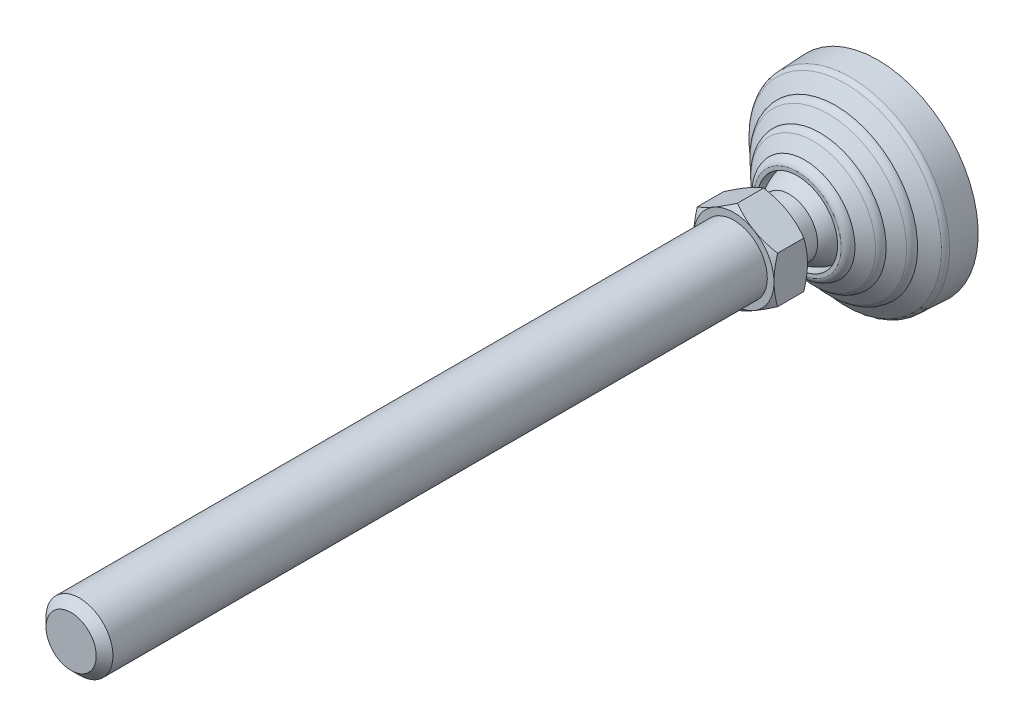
ISO-10303-21;
HEADER;
FILE_DESCRIPTION(('STEP AP214'),'2;1');
FILE_NAME('part.step','',(''),(''),'','','');
FILE_SCHEMA(('AUTOMOTIVE_DESIGN { 1 0 10303 214 1 1 1 1 }'));
ENDSEC;
DATA;
#1=APPLICATION_CONTEXT('core data for automotive mechanical design processes');
#2=APPLICATION_PROTOCOL_DEFINITION('international standard','automotive_design',2000,#1);
#3=PRODUCT_CONTEXT('',#1,'mechanical');
#4=PRODUCT('Part','Part','',(#3));
#5=PRODUCT_RELATED_PRODUCT_CATEGORY('part','',(#4));
#6=PRODUCT_DEFINITION_FORMATION('','',#4);
#7=PRODUCT_DEFINITION_CONTEXT('part definition',#1,'design');
#8=PRODUCT_DEFINITION('design','',#6,#7);
#9=PRODUCT_DEFINITION_SHAPE('','',#8);
#10=(LENGTH_UNIT() NAMED_UNIT(*) SI_UNIT(.MILLI.,.METRE.));
#11=(NAMED_UNIT(*) PLANE_ANGLE_UNIT() SI_UNIT($,.RADIAN.));
#12=(NAMED_UNIT(*) SI_UNIT($,.STERADIAN.) SOLID_ANGLE_UNIT());
#13=UNCERTAINTY_MEASURE_WITH_UNIT(LENGTH_MEASURE(1.E-05),#10,'distance_accuracy_value','');
#14=(GEOMETRIC_REPRESENTATION_CONTEXT(3) GLOBAL_UNCERTAINTY_ASSIGNED_CONTEXT((#13)) GLOBAL_UNIT_ASSIGNED_CONTEXT((#10,
#11,#12)) REPRESENTATION_CONTEXT('',''));
#15=CARTESIAN_POINT('',(0.,0.,0.));
#16=DIRECTION('',(0.,0.,1.));
#17=DIRECTION('',(1.,0.,0.));
#18=AXIS2_PLACEMENT_3D('',#15,#16,#17);
#19=CARTESIAN_POINT('',(0.,0.,110.4665));
#20=DIRECTION('',(0.,0.,-1.));
#21=DIRECTION('',(0.,1.,0.));
#22=AXIS2_PLACEMENT_3D('',#19,#20,#21);
#23=CYLINDRICAL_SURFACE('',#22,10.);
#24=CARTESIAN_POINT('',(0.,0.,238.5));
#25=DIRECTION('',(0.,0.,1.));
#26=DIRECTION('',(0.,-1.,0.));
#27=AXIS2_PLACEMENT_3D('',#24,#25,#26);
#28=CIRCLE('',#27,10.);
#29=CARTESIAN_POINT('',(0.,-10.,238.5));
#30=VERTEX_POINT('',#29);
#31=EDGE_CURVE('E9',#30,#30,#28,.F.);
#32=ORIENTED_EDGE('',*,*,#31,.T.);
#33=EDGE_LOOP('',(#32));
#34=FACE_BOUND('',#33,.T.);
#35=CARTESIAN_POINT('',(0.,0.,43.));
#36=DIRECTION('',(0.,0.,-1.));
#37=DIRECTION('',(0.,1.,0.));
#38=AXIS2_PLACEMENT_3D('',#35,#36,#37);
#39=CIRCLE('',#38,10.);
#40=CARTESIAN_POINT('',(0.,10.,43.));
#41=VERTEX_POINT('',#40);
#42=EDGE_CURVE('E124',#41,#41,#39,.F.);
#43=ORIENTED_EDGE('',*,*,#42,.T.);
#44=EDGE_LOOP('',(#43));
#45=FACE_BOUND('',#44,.T.);
#46=ADVANCED_FACE('F14',(#34,#45),#23,.T.);
#47=CARTESIAN_POINT('',(10.995,0.,43.));
#48=DIRECTION('',(0.,0.,1.));
#49=DIRECTION('',(0.,-1.,0.));
#50=AXIS2_PLACEMENT_3D('',#47,#48,#49);
#51=PLANE('',#50);
#52=CARTESIAN_POINT('',(0.,0.,43.));
#53=DIRECTION('',(0.,0.,-1.));
#54=DIRECTION('',(0.,1.,0.));
#55=AXIS2_PLACEMENT_3D('',#52,#53,#54);
#56=CIRCLE('',#55,11.99);
#57=CARTESIAN_POINT('',(0.,11.99,43.));
#58=VERTEX_POINT('',#57);
#59=EDGE_CURVE('E132',#58,#58,#56,.F.);
#60=ORIENTED_EDGE('',*,*,#59,.T.);
#61=EDGE_LOOP('',(#60));
#62=FACE_BOUND('',#61,.T.);
#63=ORIENTED_EDGE('',*,*,#42,.F.);
#64=EDGE_LOOP('',(#63));
#65=FACE_BOUND('',#64,.T.);
#66=ADVANCED_FACE('F157',(#62,#65),#51,.T.);
#67=CARTESIAN_POINT('',(0.,0.,41.9159643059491));
#68=DIRECTION('',(0.,0.,-1.));
#69=DIRECTION('',(0.,1.,0.));
#70=AXIS2_PLACEMENT_3D('',#67,#68,#69);
#71=CONICAL_SURFACE('',#70,13.8676048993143,1.0471975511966);
#72=ORIENTED_EDGE('',*,*,#59,.F.);
#73=EDGE_LOOP('',(#72));
#74=FACE_BOUND('',#73,.T.);
#75=CARTESIAN_POINT('',(-2.88482840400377E-08,-13.8564064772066,41.9224297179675));
#76=CARTESIAN_POINT('',(0.263784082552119,-13.7041106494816,42.0103407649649));
#77=CARTESIAN_POINT('',(0.528551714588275,-13.5512469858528,42.0942615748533));
#78=CARTESIAN_POINT('',(1.06021019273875,-13.2442938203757,42.2530155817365));
#79=CARTESIAN_POINT('',(1.32710170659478,-13.0902039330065,42.3278457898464));
#80=CARTESIAN_POINT('',(2.13207647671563,-12.6254515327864,42.537252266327));
#81=CARTESIAN_POINT('',(2.67333741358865,-12.3129543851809,42.6563603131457));
#82=CARTESIAN_POINT('',(3.48330954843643,-11.8453167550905,42.796023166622));
#83=CARTESIAN_POINT('',(3.74960108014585,-11.6915732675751,42.8358073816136));
#84=CARTESIAN_POINT('',(4.28341699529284,-11.3833745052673,42.9025217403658));
#85=CARTESIAN_POINT('',(4.55094140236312,-11.2289192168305,42.9294516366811));
#86=CARTESIAN_POINT('',(5.08643614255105,-10.9197511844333,42.9697675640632));
#87=CARTESIAN_POINT('',(5.35440556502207,-10.7650389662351,42.9831696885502));
#88=CARTESIAN_POINT('',(5.8905925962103,-10.4554712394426,42.996144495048));
#89=CARTESIAN_POINT('',(6.15881019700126,-10.3006157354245,42.9957176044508));
#90=CARTESIAN_POINT('',(6.66023029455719,-10.0111207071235,42.9820002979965));
#91=CARTESIAN_POINT('',(6.8934685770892,-9.87646052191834,42.97038309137));
#92=CARTESIAN_POINT('',(7.35940867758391,-9.60744987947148,42.9369099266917));
#93=CARTESIAN_POINT('',(7.59211045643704,-9.47309944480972,42.9150532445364));
#94=CARTESIAN_POINT('',(8.05685109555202,-9.20478131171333,42.8614821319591));
#95=CARTESIAN_POINT('',(8.28888924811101,-9.07081402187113,42.8297595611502));
#96=CARTESIAN_POINT('',(8.75187776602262,-8.80350747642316,42.7570131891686));
#97=CARTESIAN_POINT('',(8.9828280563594,-8.6701682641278,42.7159887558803));
#98=CARTESIAN_POINT('',(9.68388987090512,-8.26541003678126,42.5779256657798));
#99=CARTESIAN_POINT('',(10.1519713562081,-7.99516306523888,42.4671213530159));
#100=CARTESIAN_POINT('',(11.081155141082,-7.45869855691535,42.2156417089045));
#101=CARTESIAN_POINT('',(11.5422693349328,-7.19247415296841,42.075025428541));
#102=CARTESIAN_POINT('',(11.9999999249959,-6.92820327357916,41.922429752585));
#103=B_SPLINE_CURVE_WITH_KNOTS('',3,(#75,#76,#77,#78,#79,#80,#81,#82,#83,#84,#85,#86,#87,#88,
#89,#90,#91,#92,#93,#94,#95,#96,#97,#98,#99,#100,#101,#102),.UNSPECIFIED.,.F.,.F.,(4,2,2,2,2,2,
2,2,2,2,2,2,2,4),(0.,0.950996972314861,1.90230578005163,3.80897261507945,4.73890631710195,
5.66885791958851,6.59770188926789,7.52651715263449,8.33503482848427,9.14360968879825,
9.95285348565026,10.7621522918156,12.4163368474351,14.0672749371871),.UNSPECIFIED.);
#104=CARTESIAN_POINT('',(-1.44241383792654E-08,-13.8564064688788,41.9224297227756));
#105=VERTEX_POINT('',#104);
#106=CARTESIAN_POINT('',(12.,-6.92820324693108,41.9224297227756));
#107=VERTEX_POINT('',#106);
#108=EDGE_CURVE('E143',#105,#107,#103,.T.);
#109=ORIENTED_EDGE('',*,*,#108,.T.);
#110=CARTESIAN_POINT('',(12.,-6.92820326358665,41.9224297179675));
#111=CARTESIAN_POINT('',(12.,-6.64374493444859,42.0045333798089));
#112=CARTESIAN_POINT('',(12.,-6.35829458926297,42.0831531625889));
#113=CARTESIAN_POINT('',(12.,-5.78524260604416,42.2325348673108));
#114=CARTESIAN_POINT('',(12.,-5.49764024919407,42.3032940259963));
#115=CARTESIAN_POINT('',(12.,-4.63053083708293,42.5026195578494));
#116=CARTESIAN_POINT('',(12.,-4.04782834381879,42.6179071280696));
#117=CARTESIAN_POINT('',(12.,-3.17548925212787,42.7575170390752));
#118=CARTESIAN_POINT('',(12.,-2.88840964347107,42.7982045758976));
#119=CARTESIAN_POINT('',(12.,-2.31290718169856,42.8685767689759));
#120=CARTESIAN_POINT('',(12.,-2.02448443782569,42.8982623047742));
#121=CARTESIAN_POINT('',(12.,-1.44696804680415,42.9459902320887));
#122=CARTESIAN_POINT('',(12.,-1.15787537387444,42.9640443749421));
#123=CARTESIAN_POINT('',(12.,-0.579188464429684,42.9881624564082));
#124=CARTESIAN_POINT('',(12.,-0.289594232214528,42.994226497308));
#125=CARTESIAN_POINT('',(12.,0.289594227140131,42.9942264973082));
#126=CARTESIAN_POINT('',(12.,0.579188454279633,42.9881624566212));
#127=CARTESIAN_POINT('',(12.,1.15787535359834,42.9640443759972));
#128=CARTESIAN_POINT('',(12.,1.44696802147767,42.9459902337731));
#129=CARTESIAN_POINT('',(12.,2.02448440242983,42.8982623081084));
#130=CARTESIAN_POINT('',(12.,2.31290714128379,42.8685767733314));
#131=CARTESIAN_POINT('',(12.,2.88840959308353,42.798204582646));
#132=CARTESIAN_POINT('',(12.,3.17548919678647,42.7575170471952));
#133=CARTESIAN_POINT('',(12.,4.04782827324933,42.6179071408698));
#134=CARTESIAN_POINT('',(12.,4.63053075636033,42.5026195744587));
#135=CARTESIAN_POINT('',(12.,5.49764015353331,42.3032940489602));
#136=CARTESIAN_POINT('',(12.,5.78524250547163,42.2325348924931));
#137=CARTESIAN_POINT('',(12.,6.35829447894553,42.0831531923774));
#138=CARTESIAN_POINT('',(12.,6.64374481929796,42.004533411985));
#139=CARTESIAN_POINT('',(12.,6.92820314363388,41.9224297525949));
#140=B_SPLINE_CURVE_WITH_KNOTS('',3,(#110,#111,#112,#113,#114,#115,#116,#117,#118,#119,#120,
#121,#122,#123,#124,#125,#126,#127,#128,#129,#130,#131,#132,#133,#134,#135,#136,#137,#138,#139),
.UNSPECIFIED.,.F.,.F.,(4,2,2,2,2,2,2,2,2,2,2,2,2,2,4),(0.,0.888148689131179,1.77660860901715,
3.55698615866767,4.42666281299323,5.2962699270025,6.16499708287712,7.03371682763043,
7.90243655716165,8.7711636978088,9.64077079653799,10.5104474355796,12.2908249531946,
13.1792848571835,14.0674335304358),.UNSPECIFIED.);
#141=CARTESIAN_POINT('',(12.0000000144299,6.92820322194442,41.9224297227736));
#142=VERTEX_POINT('',#141);
#143=EDGE_CURVE('E135',#107,#142,#140,.T.);
#144=ORIENTED_EDGE('',*,*,#143,.T.);
#145=CARTESIAN_POINT('',(12.0000000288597,6.92820321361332,41.9224297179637));
#146=CARTESIAN_POINT('',(11.7362159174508,7.08049904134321,42.0103407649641));
#147=CARTESIAN_POINT('',(11.4714482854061,7.23336270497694,42.0942615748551));
#148=CARTESIAN_POINT('',(10.9397898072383,7.54031587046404,42.2530155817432));
#149=CARTESIAN_POINT('',(10.6728982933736,7.69440575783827,42.3278457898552));
#150=CARTESIAN_POINT('',(9.86792352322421,8.15915815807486,42.5372522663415));
#151=CARTESIAN_POINT('',(9.32666258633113,8.47165530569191,42.6563603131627));
#152=CARTESIAN_POINT('',(8.51669045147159,8.93929293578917,42.7960231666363));
#153=CARTESIAN_POINT('',(8.25039891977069,9.0930364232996,42.8358073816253));
#154=CARTESIAN_POINT('',(7.71658300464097,9.40123518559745,42.9025217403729));
#155=CARTESIAN_POINT('',(7.44905859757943,9.55569047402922,42.9294516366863));
#156=CARTESIAN_POINT('',(6.91356385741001,9.86485850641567,42.9697675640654));
#157=CARTESIAN_POINT('',(6.64559443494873,10.0195707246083,42.9831696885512));
#158=CARTESIAN_POINT('',(6.10940740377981,10.3291384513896,42.996144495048));
#159=CARTESIAN_POINT('',(5.84118980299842,10.4839939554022,42.9957176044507));
#160=CARTESIAN_POINT('',(5.33976970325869,10.773488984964,42.9820002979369));
#161=CARTESIAN_POINT('',(5.10653141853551,10.9081491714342,42.970383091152));
#162=CARTESIAN_POINT('',(4.64059131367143,11.1771598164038,42.9369099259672));
#163=CARTESIAN_POINT('',(4.4078895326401,11.3115102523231,42.9150532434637));
#164=CARTESIAN_POINT('',(3.94314888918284,11.5798283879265,42.8614821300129));
#165=CARTESIAN_POINT('',(3.71111073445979,11.7137956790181,42.8297595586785));
#166=CARTESIAN_POINT('',(3.24812221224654,11.9811022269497,42.7570131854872));
#167=CARTESIAN_POINT('',(3.01717191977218,12.1144414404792,42.7159887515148));
#168=CARTESIAN_POINT('',(2.31611009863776,12.5191996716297,42.5779256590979));
#169=CARTESIAN_POINT('',(1.84802860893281,12.7894466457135,42.4671213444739));
#170=CARTESIAN_POINT('',(0.918844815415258,13.3259111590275,42.2156416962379));
#171=CARTESIAN_POINT('',(0.457730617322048,13.5921355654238,42.0750254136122));
#172=CARTESIAN_POINT('',(2.30778996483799E-08,13.856406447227,41.9224297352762));
#173=B_SPLINE_CURVE_WITH_KNOTS('',3,(#145,#146,#147,#148,#149,#150,#151,#152,#153,#154,#155,
#156,#157,#158,#159,#160,#161,#162,#163,#164,#165,#166,#167,#168,#169,#170,#171,#172),
.UNSPECIFIED.,.F.,.F.,(4,2,2,2,2,2,2,2,2,2,2,2,2,4),(0.,0.95099697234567,1.9023057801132,
3.8089726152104,4.73890631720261,5.66885791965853,6.59770188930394,7.52651715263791,
8.33503483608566,9.14360970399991,9.95285350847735,10.7621523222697,12.4163368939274,
14.0672749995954),.UNSPECIFIED.);
#174=CARTESIAN_POINT('',(-1.15389591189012E-08,13.856406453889,41.92242973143));
#175=VERTEX_POINT('',#174);
#176=EDGE_CURVE('E180',#142,#175,#173,.T.);
#177=ORIENTED_EDGE('',*,*,#176,.T.);
#178=CARTESIAN_POINT('',(-2.30779115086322E-08,13.856406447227,41.9224297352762));
#179=CARTESIAN_POINT('',(-0.263784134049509,13.7041106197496,42.0103407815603));
#180=CARTESIAN_POINT('',(-0.528551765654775,13.5512469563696,42.0942615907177));
#181=CARTESIAN_POINT('',(-1.06021024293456,13.2442937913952,42.2530155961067));
#182=CARTESIAN_POINT('',(-1.32710175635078,13.0902039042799,42.3278458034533));
#183=CARTESIAN_POINT('',(-2.13207652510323,12.6254515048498,42.5372522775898));
#184=CARTESIAN_POINT('',(-2.6733374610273,12.3129543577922,42.656360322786));
#185=CARTESIAN_POINT('',(-3.48330959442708,11.8453167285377,42.7960231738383));
#186=CARTESIAN_POINT('',(-3.74960112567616,11.6915732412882,42.8358073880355));
#187=CARTESIAN_POINT('',(-4.28341703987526,11.3833744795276,42.9025217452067));
#188=CARTESIAN_POINT('',(-4.550941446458,11.2289191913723,42.9294516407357));
#189=CARTESIAN_POINT('',(-5.08643618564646,10.9197511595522,42.9697675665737));
#190=CARTESIAN_POINT('',(-5.35440560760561,10.7650389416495,42.9831696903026));
#191=CARTESIAN_POINT('',(-5.89059263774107,10.4554712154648,42.9961444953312));
#192=CARTESIAN_POINT('',(-6.15881023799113,10.300615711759,42.9957176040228));
#193=CARTESIAN_POINT('',(-6.66023033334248,10.0111206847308,42.9820002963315));
#194=CARTESIAN_POINT('',(-6.89346861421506,9.87646050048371,42.9703830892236));
#195=CARTESIAN_POINT('',(-7.359408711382,9.60744985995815,42.9369099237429));
#196=CARTESIAN_POINT('',(-7.59211048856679,9.4730994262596,42.9150532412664));
#197=CARTESIAN_POINT('',(-8.05685112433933,9.20478129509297,42.8614821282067));
#198=CARTESIAN_POINT('',(-8.28888927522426,9.07081400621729,42.8297595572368));
#199=CARTESIAN_POINT('',(-8.75187778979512,8.8035074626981,42.7570131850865));
#200=CARTESIAN_POINT('',(-8.98282807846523,8.67016825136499,42.7159887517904));
#201=CARTESIAN_POINT('',(-9.68388988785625,8.26541002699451,42.5779256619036));
#202=CARTESIAN_POINT('',(-10.1519713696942,7.9951630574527,42.4671213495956));
#203=CARTESIAN_POINT('',(-11.0811551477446,7.45869855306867,42.2156417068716));
#204=CARTESIAN_POINT('',(-11.5422693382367,7.19247415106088,42.0750254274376));
#205=CARTESIAN_POINT('',(-11.9999999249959,6.92820327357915,41.922429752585));
#206=B_SPLINE_CURVE_WITH_KNOTS('',3,(#178,#179,#180,#181,#182,#183,#184,#185,#186,#187,#188,
#189,#190,#191,#192,#193,#194,#195,#196,#197,#198,#199,#200,#201,#202,#203,#204,#205),
.UNSPECIFIED.,.F.,.F.,(4,2,2,2,2,2,2,2,2,2,2,2,2,4),(0.,0.9509969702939,1.90230577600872,
3.80897260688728,4.73890630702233,5.6688579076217,6.59770187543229,7.52651713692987,
8.33503480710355,9.14360966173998,9.95285345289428,10.7621522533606,12.4163367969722,
14.0672748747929),.UNSPECIFIED.);
#207=CARTESIAN_POINT('',(-12.,6.92820324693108,41.9224297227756));
#208=VERTEX_POINT('',#207);
#209=EDGE_CURVE('E172',#175,#208,#206,.T.);
#210=ORIENTED_EDGE('',*,*,#209,.T.);
#211=CARTESIAN_POINT('',(-12.,6.92820326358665,41.9224297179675));
#212=CARTESIAN_POINT('',(-12.,6.64374493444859,42.0045333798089));
#213=CARTESIAN_POINT('',(-12.,6.35829458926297,42.0831531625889));
#214=CARTESIAN_POINT('',(-12.,5.78524260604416,42.2325348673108));
#215=CARTESIAN_POINT('',(-12.,5.49764024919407,42.3032940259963));
#216=CARTESIAN_POINT('',(-12.,4.63053083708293,42.5026195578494));
#217=CARTESIAN_POINT('',(-12.,4.04782834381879,42.6179071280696));
#218=CARTESIAN_POINT('',(-12.,3.17548925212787,42.7575170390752));
#219=CARTESIAN_POINT('',(-12.,2.88840964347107,42.7982045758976));
#220=CARTESIAN_POINT('',(-12.,2.31290718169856,42.8685767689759));
#221=CARTESIAN_POINT('',(-12.,2.02448443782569,42.8982623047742));
#222=CARTESIAN_POINT('',(-12.,1.44696804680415,42.9459902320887));
#223=CARTESIAN_POINT('',(-12.,1.15787537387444,42.9640443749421));
#224=CARTESIAN_POINT('',(-12.,0.579188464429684,42.9881624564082));
#225=CARTESIAN_POINT('',(-12.,0.289594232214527,42.994226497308));
#226=CARTESIAN_POINT('',(-12.,-0.289594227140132,42.9942264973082));
#227=CARTESIAN_POINT('',(-12.,-0.579188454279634,42.9881624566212));
#228=CARTESIAN_POINT('',(-12.,-1.15787535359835,42.9640443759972));
#229=CARTESIAN_POINT('',(-12.,-1.44696802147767,42.9459902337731));
#230=CARTESIAN_POINT('',(-12.,-2.02448440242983,42.8982623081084));
#231=CARTESIAN_POINT('',(-12.,-2.31290714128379,42.8685767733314));
#232=CARTESIAN_POINT('',(-12.,-2.88840959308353,42.798204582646));
#233=CARTESIAN_POINT('',(-12.,-3.17548919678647,42.7575170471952));
#234=CARTESIAN_POINT('',(-12.,-4.04782827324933,42.6179071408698));
#235=CARTESIAN_POINT('',(-12.,-4.63053075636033,42.5026195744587));
#236=CARTESIAN_POINT('',(-12.,-5.49764015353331,42.3032940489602));
#237=CARTESIAN_POINT('',(-12.,-5.78524250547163,42.2325348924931));
#238=CARTESIAN_POINT('',(-12.,-6.35829447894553,42.0831531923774));
#239=CARTESIAN_POINT('',(-12.,-6.64374481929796,42.004533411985));
#240=CARTESIAN_POINT('',(-12.,-6.92820314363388,41.9224297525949));
#241=B_SPLINE_CURVE_WITH_KNOTS('',3,(#211,#212,#213,#214,#215,#216,#217,#218,#219,#220,#221,
#222,#223,#224,#225,#226,#227,#228,#229,#230,#231,#232,#233,#234,#235,#236,#237,#238,#239,#240),
.UNSPECIFIED.,.F.,.F.,(4,2,2,2,2,2,2,2,2,2,2,2,2,2,4),(0.,0.888148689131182,1.77660860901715,
3.55698615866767,4.42666281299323,5.2962699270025,6.16499708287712,7.03371682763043,
7.90243655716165,8.7711636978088,9.64077079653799,10.5104474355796,12.2908249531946,
13.1792848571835,14.0674335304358),.UNSPECIFIED.);
#242=CARTESIAN_POINT('',(-12.0000000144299,-6.92820322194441,41.9224297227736));
#243=VERTEX_POINT('',#242);
#244=EDGE_CURVE('E342',#208,#243,#241,.T.);
#245=ORIENTED_EDGE('',*,*,#244,.T.);
#246=CARTESIAN_POINT('',(-12.0000000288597,-6.92820321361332,41.9224297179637));
#247=CARTESIAN_POINT('',(-11.7362159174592,-7.08049904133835,42.0103407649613));
#248=CARTESIAN_POINT('',(-11.471448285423,-7.23336270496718,42.0942615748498));
#249=CARTESIAN_POINT('',(-10.9397898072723,-7.54031587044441,42.2530155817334));
#250=CARTESIAN_POINT('',(-10.6728982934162,-7.69440575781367,42.3278457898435));
#251=CARTESIAN_POINT('',(-9.86792352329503,-8.15915815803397,42.5372522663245));
#252=CARTESIAN_POINT('',(-9.3266625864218,-8.47165530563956,42.6563603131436));
#253=CARTESIAN_POINT('',(-8.5166904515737,-8.93929293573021,42.7960231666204));
#254=CARTESIAN_POINT('',(-8.25039891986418,-9.09303642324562,42.8358073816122));
#255=CARTESIAN_POINT('',(-7.71658300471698,-9.40123518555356,42.9025217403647));
#256=CARTESIAN_POINT('',(-7.44905859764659,-9.55569047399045,42.9294516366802));
#257=CARTESIAN_POINT('',(-6.91356385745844,-9.8648585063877,42.9697675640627));
#258=CARTESIAN_POINT('',(-6.64559443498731,-10.019570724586,42.9831696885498));
#259=CARTESIAN_POINT('',(-6.10940740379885,-10.3291384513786,42.996144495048));
#260=CARTESIAN_POINT('',(-5.84118980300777,-10.4839939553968,42.9957176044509));
#261=CARTESIAN_POINT('',(-5.33976970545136,-10.7734889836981,42.9820002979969));
#262=CARTESIAN_POINT('',(-5.10653142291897,-10.9081491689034,42.9703830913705));
#263=CARTESIAN_POINT('',(-4.64059132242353,-11.1771598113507,42.9369099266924));
#264=CARTESIAN_POINT('',(-4.40788954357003,-11.3115102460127,42.9150532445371));
#265=CARTESIAN_POINT('',(-3.94314890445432,-11.5798283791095,42.8614821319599));
#266=CARTESIAN_POINT('',(-3.71111075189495,-11.7137956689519,42.829759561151));
#267=CARTESIAN_POINT('',(-3.24812223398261,-11.9811022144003,42.7570131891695));
#268=CARTESIAN_POINT('',(-3.01717194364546,-12.1144414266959,42.7159887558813));
#269=CARTESIAN_POINT('',(-2.3161101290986,-12.5191996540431,42.5779256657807));
#270=CARTESIAN_POINT('',(-1.84802864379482,-12.7894466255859,42.4671213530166));
#271=CARTESIAN_POINT('',(-0.918844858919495,-13.3259111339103,42.215641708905));
#272=CARTESIAN_POINT('',(-0.457730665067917,-13.5921355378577,42.0750254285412));
#273=CARTESIAN_POINT('',(-7.50040961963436E-08,-13.8564064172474,41.922429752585));
#274=B_SPLINE_CURVE_WITH_KNOTS('',3,(#246,#247,#248,#249,#250,#251,#252,#253,#254,#255,#256,
#257,#258,#259,#260,#261,#262,#263,#264,#265,#266,#267,#268,#269,#270,#271,#272,#273),
.UNSPECIFIED.,.F.,.F.,(4,2,2,2,2,2,2,2,2,2,2,2,2,4),(0.,0.950996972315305,1.90230578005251,
3.80897261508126,4.73890631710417,5.66885791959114,6.59770188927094,7.52651715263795,
8.33503482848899,9.14360968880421,9.95285348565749,10.7621522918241,12.4163368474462,
14.0672749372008),.UNSPECIFIED.);
#275=EDGE_CURVE('E162',#243,#105,#274,.T.);
#276=ORIENTED_EDGE('',*,*,#275,.T.);
#277=EDGE_LOOP('',(#109,#144,#177,#210,#245,#276));
#278=FACE_BOUND('',#277,.T.);
#279=ADVANCED_FACE('F152',(#74,#278),#71,.T.);
#280=CARTESIAN_POINT('',(0.,-13.856406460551,43.1));
#281=DIRECTION('',(0.5,0.866025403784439,0.));
#282=DIRECTION('',(-0.866025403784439,0.5,0.));
#283=AXIS2_PLACEMENT_3D('',#280,#281,#282);
#284=PLANE('',#283);
#285=DIRECTION('',(0.,0.,1.));
#286=VECTOR('',#285,1.);
#287=CARTESIAN_POINT('',(0.,-13.856406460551,43.1));
#288=LINE('',#287,#286);
#289=CARTESIAN_POINT('',(0.,-13.856406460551,34.0775702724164));
#290=VERTEX_POINT('',#289);
#291=EDGE_CURVE('E368',#290,#105,#288,.T.);
#292=ORIENTED_EDGE('',*,*,#291,.T.);
#293=ORIENTED_EDGE('',*,*,#275,.F.);
#294=DIRECTION('',(0.,0.,1.));
#295=VECTOR('',#294,1.);
#296=CARTESIAN_POINT('',(-12.,-6.9282032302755,43.1));
#297=LINE('',#296,#295);
#298=CARTESIAN_POINT('',(-12.,-6.9282032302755,34.0775702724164));
#299=VERTEX_POINT('',#298);
#300=EDGE_CURVE('E360',#299,#243,#297,.T.);
#301=ORIENTED_EDGE('',*,*,#300,.F.);
#302=CARTESIAN_POINT('',(0.,-13.856406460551,34.0775702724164));
#303=CARTESIAN_POINT('',(-0.263784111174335,-13.7041106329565,33.9896592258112));
#304=CARTESIAN_POINT('',(-0.528551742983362,-13.5512469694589,33.9057384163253));
#305=CARTESIAN_POINT('',(-1.0602102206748,-13.2442938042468,33.7469844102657));
#306=CARTESIAN_POINT('',(-1.32710173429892,-13.0902039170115,33.6721542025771));
#307=CARTESIAN_POINT('',(-2.13207650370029,-12.6254515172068,33.4627477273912));
#308=CARTESIAN_POINT('',(-2.67333744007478,-12.3129543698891,33.3436396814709));
#309=CARTESIAN_POINT('',(-3.48330957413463,-11.8453167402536,33.2039768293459));
#310=CARTESIAN_POINT('',(-3.74960110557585,-11.6915732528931,33.1641926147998));
#311=CARTESIAN_POINT('',(-4.28341702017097,-11.3833744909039,33.097478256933));
#312=CARTESIAN_POINT('',(-4.55094142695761,-11.2289192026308,33.0705483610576));
#313=CARTESIAN_POINT('',(-5.08643616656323,-10.9197511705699,33.0302324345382));
#314=CARTESIAN_POINT('',(-5.35440558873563,-10.765038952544,33.0168303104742));
#315=CARTESIAN_POINT('',(-5.89059261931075,-10.4554712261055,33.0038555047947));
#316=CARTESIAN_POINT('',(-6.15881021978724,-10.300615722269,33.0042823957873));
#317=CARTESIAN_POINT('',(-6.66023031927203,-10.0111206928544,33.0179997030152));
#318=CARTESIAN_POINT('',(-6.8934686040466,-9.87646050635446,33.029616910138));
#319=CARTESIAN_POINT('',(-7.35940870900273,-9.6074498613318,33.063090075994));
#320=CARTESIAN_POINT('',(-7.59211049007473,-9.47309942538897,33.0849467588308));
#321=CARTESIAN_POINT('',(-8.05685113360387,-9.20478128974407,33.1385178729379));
#322=CARTESIAN_POINT('',(-8.28888928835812,-9.07081399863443,33.1702404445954));
#323=CARTESIAN_POINT('',(-8.75187781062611,-8.8035074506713,33.2429868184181));
#324=CARTESIAN_POINT('',(-8.98282810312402,-8.67016823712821,33.2840112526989));
#325=CARTESIAN_POINT('',(-9.6838899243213,-8.2654100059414,33.4220743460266));
#326=CARTESIAN_POINT('',(-10.1519714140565,-7.99516303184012,33.5328786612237));
#327=CARTESIAN_POINT('',(-11.0811552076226,-7.45869851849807,33.7843583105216));
#328=CARTESIAN_POINT('',(-11.5422694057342,-7.19247411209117,33.924974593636));
#329=CARTESIAN_POINT('',(-12.,-6.9282032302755,34.0775702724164));
#330=B_SPLINE_CURVE_WITH_KNOTS('',3,(#302,#303,#304,#305,#306,#307,#308,#309,#310,#311,#312,
#313,#314,#315,#316,#317,#318,#319,#320,#321,#322,#323,#324,#325,#326,#327,#328,#329),
.UNSPECIFIED.,.F.,.F.,(4,2,2,2,2,2,2,2,2,2,2,2,2,4),(0.,0.950996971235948,1.90230577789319,
3.80897261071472,4.73890631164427,5.66885791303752,6.59770188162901,7.52651714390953,
8.33503482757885,9.14360969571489,9.9528535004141,10.7621523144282,12.4163368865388,
14.0672749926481),.UNSPECIFIED.);
#331=EDGE_CURVE('E362',#290,#299,#330,.T.);
#332=ORIENTED_EDGE('',*,*,#331,.F.);
#333=EDGE_LOOP('',(#292,#293,#301,#332));
#334=FACE_BOUND('',#333,.T.);
#335=ADVANCED_FACE('F156',(#334),#284,.F.);
#336=CARTESIAN_POINT('',(12.,-6.92820323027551,43.1));
#337=DIRECTION('',(-0.5,0.866025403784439,0.));
#338=DIRECTION('',(-0.866025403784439,-0.5,0.));
#339=AXIS2_PLACEMENT_3D('',#336,#337,#338);
#340=PLANE('',#339);
#341=DIRECTION('',(0.,0.,1.));
#342=VECTOR('',#341,1.);
#343=CARTESIAN_POINT('',(12.,-6.92820323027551,43.1));
#344=LINE('',#343,#342);
#345=CARTESIAN_POINT('',(12.,-6.92820323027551,34.0775702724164));
#346=VERTEX_POINT('',#345);
#347=EDGE_CURVE('E31',#346,#107,#344,.T.);
#348=ORIENTED_EDGE('',*,*,#347,.T.);
#349=ORIENTED_EDGE('',*,*,#108,.F.);
#350=ORIENTED_EDGE('',*,*,#291,.F.);
#351=CARTESIAN_POINT('',(12.,-6.92820323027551,34.0775702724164));
#352=CARTESIAN_POINT('',(11.7362158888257,-7.08049905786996,33.9896592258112));
#353=CARTESIAN_POINT('',(11.4714482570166,-7.2333627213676,33.9057384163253));
#354=CARTESIAN_POINT('',(10.9397897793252,-7.5403158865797,33.7469844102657));
#355=CARTESIAN_POINT('',(10.6728982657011,-7.69440577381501,33.6721542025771));
#356=CARTESIAN_POINT('',(9.86792349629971,-8.15915817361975,33.4627477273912));
#357=CARTESIAN_POINT('',(9.32666255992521,-8.4716553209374,33.3436396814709));
#358=CARTESIAN_POINT('',(8.51669042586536,-8.93929295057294,33.2039768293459));
#359=CARTESIAN_POINT('',(8.25039889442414,-9.09303643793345,33.1641926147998));
#360=CARTESIAN_POINT('',(7.71658297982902,-9.40123519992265,33.097478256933));
#361=CARTESIAN_POINT('',(7.44905857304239,-9.55569048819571,33.0705483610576));
#362=CARTESIAN_POINT('',(6.91356383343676,-9.86485852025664,33.0302324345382));
#363=CARTESIAN_POINT('',(6.64559441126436,-10.0195707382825,33.0168303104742));
#364=CARTESIAN_POINT('',(6.10940738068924,-10.329138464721,33.0038555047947));
#365=CARTESIAN_POINT('',(5.84118978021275,-10.4839939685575,33.0042823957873));
#366=CARTESIAN_POINT('',(5.33976968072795,-10.7734889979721,33.0179997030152));
#367=CARTESIAN_POINT('',(5.10653139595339,-10.9081491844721,33.029616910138));
#368=CARTESIAN_POINT('',(4.64059129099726,-11.1771598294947,33.063090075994));
#369=CARTESIAN_POINT('',(4.40788950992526,-11.3115102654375,33.0849467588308));
#370=CARTESIAN_POINT('',(3.94314886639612,-11.5798284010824,33.1385178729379));
#371=CARTESIAN_POINT('',(3.71111071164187,-11.7137956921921,33.1702404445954));
#372=CARTESIAN_POINT('',(3.24812218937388,-11.9811022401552,33.2429868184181));
#373=CARTESIAN_POINT('',(3.01717189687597,-12.1144414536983,33.2840112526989));
#374=CARTESIAN_POINT('',(2.3161100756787,-12.5191996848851,33.4220743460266));
#375=CARTESIAN_POINT('',(1.84802858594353,-12.7894466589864,33.5328786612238));
#376=CARTESIAN_POINT('',(0.918844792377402,-13.3259111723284,33.7843583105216));
#377=CARTESIAN_POINT('',(0.457730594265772,-13.5921355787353,33.924974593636));
#378=CARTESIAN_POINT('',(0.,-13.856406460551,34.0775702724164));
#379=B_SPLINE_CURVE_WITH_KNOTS('',3,(#351,#352,#353,#354,#355,#356,#357,#358,#359,#360,#361,
#362,#363,#364,#365,#366,#367,#368,#369,#370,#371,#372,#373,#374,#375,#376,#377,#378),
.UNSPECIFIED.,.F.,.F.,(4,2,2,2,2,2,2,2,2,2,2,2,2,4),(0.,0.95099697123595,1.90230577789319,
3.80897261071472,4.73890631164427,5.66885791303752,6.59770188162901,7.52651714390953,
8.33503482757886,9.14360969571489,9.9528535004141,10.7621523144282,12.4163368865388,
14.0672749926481),.UNSPECIFIED.);
#380=EDGE_CURVE('E369',#346,#290,#379,.T.);
#381=ORIENTED_EDGE('',*,*,#380,.F.);
#382=EDGE_LOOP('',(#348,#349,#350,#381));
#383=FACE_BOUND('',#382,.T.);
#384=ADVANCED_FACE('F375',(#383),#340,.F.);
#385=CARTESIAN_POINT('',(-12.,6.92820323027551,43.1));
#386=DIRECTION('',(0.5,-0.866025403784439,0.));
#387=DIRECTION('',(0.866025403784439,0.5,0.));
#388=AXIS2_PLACEMENT_3D('',#385,#386,#387);
#389=PLANE('',#388);
#390=DIRECTION('',(0.,0.,1.));
#391=VECTOR('',#390,1.);
#392=CARTESIAN_POINT('',(-12.,6.92820323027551,43.1));
#393=LINE('',#392,#391);
#394=CARTESIAN_POINT('',(-12.,6.92820323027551,34.0775702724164));
#395=VERTEX_POINT('',#394);
#396=EDGE_CURVE('E361',#395,#208,#393,.T.);
#397=ORIENTED_EDGE('',*,*,#396,.T.);
#398=ORIENTED_EDGE('',*,*,#209,.F.);
#399=DIRECTION('',(0.,0.,1.));
#400=VECTOR('',#399,1.);
#401=CARTESIAN_POINT('',(0.,13.856406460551,43.1));
#402=LINE('',#401,#400);
#403=CARTESIAN_POINT('',(0.,13.856406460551,34.0775702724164));
#404=VERTEX_POINT('',#403);
#405=EDGE_CURVE('E211',#404,#175,#402,.T.);
#406=ORIENTED_EDGE('',*,*,#405,.F.);
#407=CARTESIAN_POINT('',(-12.,6.92820323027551,34.0775702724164));
#408=CARTESIAN_POINT('',(-11.7362158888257,7.08049905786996,33.9896592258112));
#409=CARTESIAN_POINT('',(-11.4714482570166,7.2333627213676,33.9057384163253));
#410=CARTESIAN_POINT('',(-10.9397897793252,7.5403158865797,33.7469844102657));
#411=CARTESIAN_POINT('',(-10.6728982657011,7.69440577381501,33.6721542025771));
#412=CARTESIAN_POINT('',(-9.86792349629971,8.15915817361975,33.4627477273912));
#413=CARTESIAN_POINT('',(-9.32666255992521,8.4716553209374,33.3436396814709));
#414=CARTESIAN_POINT('',(-8.51669042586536,8.93929295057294,33.2039768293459));
#415=CARTESIAN_POINT('',(-8.25039889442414,9.09303643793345,33.1641926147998));
#416=CARTESIAN_POINT('',(-7.71658297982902,9.40123519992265,33.097478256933));
#417=CARTESIAN_POINT('',(-7.44905857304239,9.55569048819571,33.0705483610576));
#418=CARTESIAN_POINT('',(-6.91356383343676,9.86485852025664,33.0302324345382));
#419=CARTESIAN_POINT('',(-6.64559441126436,10.0195707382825,33.0168303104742));
#420=CARTESIAN_POINT('',(-6.10940738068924,10.329138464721,33.0038555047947));
#421=CARTESIAN_POINT('',(-5.84118978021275,10.4839939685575,33.0042823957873));
#422=CARTESIAN_POINT('',(-5.33976968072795,10.7734889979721,33.0179997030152));
#423=CARTESIAN_POINT('',(-5.10653139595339,10.9081491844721,33.029616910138));
#424=CARTESIAN_POINT('',(-4.64059129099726,11.1771598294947,33.063090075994));
#425=CARTESIAN_POINT('',(-4.40788950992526,11.3115102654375,33.0849467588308));
#426=CARTESIAN_POINT('',(-3.94314886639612,11.5798284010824,33.1385178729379));
#427=CARTESIAN_POINT('',(-3.71111071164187,11.7137956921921,33.1702404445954));
#428=CARTESIAN_POINT('',(-3.24812218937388,11.9811022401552,33.2429868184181));
#429=CARTESIAN_POINT('',(-3.01717189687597,12.1144414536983,33.2840112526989));
#430=CARTESIAN_POINT('',(-2.3161100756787,12.5191996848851,33.4220743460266));
#431=CARTESIAN_POINT('',(-1.84802858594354,12.7894466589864,33.5328786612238));
#432=CARTESIAN_POINT('',(-0.918844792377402,13.3259111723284,33.7843583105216));
#433=CARTESIAN_POINT('',(-0.457730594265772,13.5921355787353,33.924974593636));
#434=CARTESIAN_POINT('',(0.,13.856406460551,34.0775702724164));
#435=B_SPLINE_CURVE_WITH_KNOTS('',3,(#407,#408,#409,#410,#411,#412,#413,#414,#415,#416,#417,
#418,#419,#420,#421,#422,#423,#424,#425,#426,#427,#428,#429,#430,#431,#432,#433,#434),
.UNSPECIFIED.,.F.,.F.,(4,2,2,2,2,2,2,2,2,2,2,2,2,4),(0.,0.95099697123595,1.90230577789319,
3.80897261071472,4.73890631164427,5.66885791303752,6.59770188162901,7.52651714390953,
8.33503482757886,9.14360969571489,9.9528535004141,10.7621523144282,12.4163368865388,
14.0672749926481),.UNSPECIFIED.);
#436=EDGE_CURVE('E213',#395,#404,#435,.T.);
#437=ORIENTED_EDGE('',*,*,#436,.F.);
#438=EDGE_LOOP('',(#397,#398,#406,#437));
#439=FACE_BOUND('',#438,.T.);
#440=ADVANCED_FACE('F199',(#439),#389,.F.);
#441=CARTESIAN_POINT('',(-12.,-6.92820323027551,43.1));
#442=DIRECTION('',(1.,0.,0.));
#443=DIRECTION('',(0.,1.,0.));
#444=AXIS2_PLACEMENT_3D('',#441,#442,#443);
#445=PLANE('',#444);
#446=ORIENTED_EDGE('',*,*,#300,.T.);
#447=ORIENTED_EDGE('',*,*,#244,.F.);
#448=ORIENTED_EDGE('',*,*,#396,.F.);
#449=CARTESIAN_POINT('',(-12.,-6.9282032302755,34.0775702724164));
#450=CARTESIAN_POINT('',(-12.,-6.64374490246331,33.9954666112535));
#451=CARTESIAN_POINT('',(-12.,-6.35829455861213,33.9168468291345));
#452=CARTESIAN_POINT('',(-12.,-5.78524257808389,33.7674651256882));
#453=CARTESIAN_POINT('',(-12.,-5.49764022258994,33.6967059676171));
#454=CARTESIAN_POINT('',(-12.,-4.63053081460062,33.4973804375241));
#455=CARTESIAN_POINT('',(-12.,-4.04782832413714,33.3820928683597));
#456=CARTESIAN_POINT('',(-12.,-3.17548923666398,33.2424829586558));
#457=CARTESIAN_POINT('',(-12.,-2.88840962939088,33.2017954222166));
#458=CARTESIAN_POINT('',(-12.,-2.31290717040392,33.1314232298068));
#459=CARTESIAN_POINT('',(-12.,-2.02448442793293,33.1017376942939));
#460=CARTESIAN_POINT('',(-12.,-1.44696803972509,33.0540097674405));
#461=CARTESIAN_POINT('',(-12.,-1.1578753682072,33.035955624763));
#462=CARTESIAN_POINT('',(-12.,-0.579188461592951,33.0118375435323));
#463=CARTESIAN_POINT('',(-12.,-0.289594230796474,33.0057735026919));
#464=CARTESIAN_POINT('',(-12.,0.28959423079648,33.0057735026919));
#465=CARTESIAN_POINT('',(-12.,0.579188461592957,33.0118375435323));
#466=CARTESIAN_POINT('',(-12.,1.15787536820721,33.035955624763));
#467=CARTESIAN_POINT('',(-12.,1.4469680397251,33.0540097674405));
#468=CARTESIAN_POINT('',(-12.,2.02448442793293,33.1017376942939));
#469=CARTESIAN_POINT('',(-12.,2.31290717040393,33.1314232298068));
#470=CARTESIAN_POINT('',(-12.,2.88840962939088,33.2017954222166));
#471=CARTESIAN_POINT('',(-12.,3.17548923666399,33.2424829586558));
#472=CARTESIAN_POINT('',(-12.,4.04782832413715,33.3820928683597));
#473=CARTESIAN_POINT('',(-12.,4.63053081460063,33.4973804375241));
#474=CARTESIAN_POINT('',(-12.,5.49764022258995,33.6967059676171));
#475=CARTESIAN_POINT('',(-12.,5.7852425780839,33.7674651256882));
#476=CARTESIAN_POINT('',(-12.,6.35829455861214,33.9168468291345));
#477=CARTESIAN_POINT('',(-12.,6.64374490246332,33.9954666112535));
#478=CARTESIAN_POINT('',(-12.,6.92820323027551,34.0775702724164));
#479=B_SPLINE_CURVE_WITH_KNOTS('',3,(#449,#450,#451,#452,#453,#454,#455,#456,#457,#458,#459,
#460,#461,#462,#463,#464,#465,#466,#467,#468,#469,#470,#471,#472,#473,#474,#475,#476,#477,#478),
.UNSPECIFIED.,.F.,.F.,(4,2,2,2,2,2,2,2,2,2,2,2,2,2,4),(0.,0.888148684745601,1.77660860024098,
3.55698614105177,4.42666279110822,5.29626990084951,6.16499705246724,7.03371679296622,
7.90243653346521,8.77116368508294,9.64077079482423,10.5104474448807,12.2908249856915,
13.1792849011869,14.0674335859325),.UNSPECIFIED.);
#480=EDGE_CURVE('E354',#299,#395,#479,.T.);
#481=ORIENTED_EDGE('',*,*,#480,.F.);
#482=EDGE_LOOP('',(#446,#447,#448,#481));
#483=FACE_BOUND('',#482,.T.);
#484=ADVANCED_FACE('F348',(#483),#445,.F.);
#485=CARTESIAN_POINT('',(12.,6.92820323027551,43.1));
#486=DIRECTION('',(-1.,0.,0.));
#487=DIRECTION('',(0.,-1.,0.));
#488=AXIS2_PLACEMENT_3D('',#485,#486,#487);
#489=PLANE('',#488);
#490=DIRECTION('',(0.,0.,1.));
#491=VECTOR('',#490,1.);
#492=CARTESIAN_POINT('',(12.,6.92820323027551,43.1));
#493=LINE('',#492,#491);
#494=CARTESIAN_POINT('',(12.,6.9282032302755,34.0775702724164));
#495=VERTEX_POINT('',#494);
#496=EDGE_CURVE('E402',#142,#495,#493,.F.);
#497=ORIENTED_EDGE('',*,*,#496,.F.);
#498=ORIENTED_EDGE('',*,*,#143,.F.);
#499=ORIENTED_EDGE('',*,*,#347,.F.);
#500=CARTESIAN_POINT('',(12.,6.92820323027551,34.0775702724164));
#501=CARTESIAN_POINT('',(12.,6.64374490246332,33.9954666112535));
#502=CARTESIAN_POINT('',(12.,6.35829455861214,33.9168468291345));
#503=CARTESIAN_POINT('',(12.,5.7852425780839,33.7674651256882));
#504=CARTESIAN_POINT('',(12.,5.49764022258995,33.6967059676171));
#505=CARTESIAN_POINT('',(12.,4.63053081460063,33.4973804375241));
#506=CARTESIAN_POINT('',(12.,4.04782832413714,33.3820928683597));
#507=CARTESIAN_POINT('',(12.,3.17548923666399,33.2424829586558));
#508=CARTESIAN_POINT('',(12.,2.88840962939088,33.2017954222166));
#509=CARTESIAN_POINT('',(12.,2.31290717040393,33.1314232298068));
#510=CARTESIAN_POINT('',(12.,2.02448442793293,33.1017376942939));
#511=CARTESIAN_POINT('',(12.,1.4469680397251,33.0540097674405));
#512=CARTESIAN_POINT('',(12.,1.1578753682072,33.035955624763));
#513=CARTESIAN_POINT('',(12.,0.579188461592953,33.0118375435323));
#514=CARTESIAN_POINT('',(12.,0.289594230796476,33.0057735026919));
#515=CARTESIAN_POINT('',(12.,-0.289594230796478,33.0057735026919));
#516=CARTESIAN_POINT('',(12.,-0.579188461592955,33.0118375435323));
#517=CARTESIAN_POINT('',(12.,-1.15787536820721,33.035955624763));
#518=CARTESIAN_POINT('',(12.,-1.4469680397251,33.0540097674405));
#519=CARTESIAN_POINT('',(12.,-2.02448442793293,33.1017376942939));
#520=CARTESIAN_POINT('',(12.,-2.31290717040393,33.1314232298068));
#521=CARTESIAN_POINT('',(12.,-2.88840962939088,33.2017954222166));
#522=CARTESIAN_POINT('',(12.,-3.17548923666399,33.2424829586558));
#523=CARTESIAN_POINT('',(12.,-4.04782832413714,33.3820928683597));
#524=CARTESIAN_POINT('',(12.,-4.63053081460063,33.4973804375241));
#525=CARTESIAN_POINT('',(12.,-5.49764022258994,33.6967059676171));
#526=CARTESIAN_POINT('',(12.,-5.78524257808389,33.7674651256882));
#527=CARTESIAN_POINT('',(12.,-6.35829455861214,33.9168468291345));
#528=CARTESIAN_POINT('',(12.,-6.64374490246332,33.9954666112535));
#529=CARTESIAN_POINT('',(12.,-6.92820323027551,34.0775702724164));
#530=B_SPLINE_CURVE_WITH_KNOTS('',3,(#500,#501,#502,#503,#504,#505,#506,#507,#508,#509,#510,
#511,#512,#513,#514,#515,#516,#517,#518,#519,#520,#521,#522,#523,#524,#525,#526,#527,#528,#529),
.UNSPECIFIED.,.F.,.F.,(4,2,2,2,2,2,2,2,2,2,2,2,2,2,4),(0.,0.888148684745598,1.77660860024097,
3.55698614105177,4.42666279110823,5.29626990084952,6.16499705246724,7.03371679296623,
7.90243653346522,8.77116368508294,9.64077079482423,10.5104474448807,12.2908249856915,
13.1792849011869,14.0674335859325),.UNSPECIFIED.);
#531=EDGE_CURVE('E188',#495,#346,#530,.T.);
#532=ORIENTED_EDGE('',*,*,#531,.F.);
#533=EDGE_LOOP('',(#497,#498,#499,#532));
#534=FACE_BOUND('',#533,.T.);
#535=ADVANCED_FACE('F150',(#534),#489,.F.);
#536=CARTESIAN_POINT('',(0.,13.856406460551,43.1));
#537=DIRECTION('',(-0.5,-0.866025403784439,0.));
#538=DIRECTION('',(0.866025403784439,-0.5,0.));
#539=AXIS2_PLACEMENT_3D('',#536,#537,#538);
#540=PLANE('',#539);
#541=ORIENTED_EDGE('',*,*,#405,.T.);
#542=ORIENTED_EDGE('',*,*,#176,.F.);
#543=ORIENTED_EDGE('',*,*,#496,.T.);
#544=CARTESIAN_POINT('',(0.,13.856406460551,34.0775702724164));
#545=CARTESIAN_POINT('',(0.263784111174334,13.7041106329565,33.9896592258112));
#546=CARTESIAN_POINT('',(0.528551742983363,13.5512469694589,33.9057384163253));
#547=CARTESIAN_POINT('',(1.0602102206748,13.2442938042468,33.7469844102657));
#548=CARTESIAN_POINT('',(1.32710173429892,13.0902039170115,33.6721542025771));
#549=CARTESIAN_POINT('',(2.13207650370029,12.6254515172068,33.4627477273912));
#550=CARTESIAN_POINT('',(2.67333744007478,12.3129543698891,33.3436396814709));
#551=CARTESIAN_POINT('',(3.48330957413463,11.8453167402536,33.2039768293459));
#552=CARTESIAN_POINT('',(3.74960110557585,11.6915732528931,33.1641926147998));
#553=CARTESIAN_POINT('',(4.28341702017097,11.3833744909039,33.097478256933));
#554=CARTESIAN_POINT('',(4.55094142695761,11.2289192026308,33.0705483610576));
#555=CARTESIAN_POINT('',(5.08643616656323,10.9197511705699,33.0302324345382));
#556=CARTESIAN_POINT('',(5.35440558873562,10.765038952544,33.0168303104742));
#557=CARTESIAN_POINT('',(5.89059261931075,10.4554712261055,33.0038555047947));
#558=CARTESIAN_POINT('',(6.15881021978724,10.300615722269,33.0042823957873));
#559=CARTESIAN_POINT('',(6.66023031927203,10.0111206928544,33.0179997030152));
#560=CARTESIAN_POINT('',(6.8934686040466,9.87646050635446,33.029616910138));
#561=CARTESIAN_POINT('',(7.35940870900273,9.6074498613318,33.063090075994));
#562=CARTESIAN_POINT('',(7.59211049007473,9.47309942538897,33.0849467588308));
#563=CARTESIAN_POINT('',(8.05685113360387,9.20478128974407,33.1385178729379));
#564=CARTESIAN_POINT('',(8.28888928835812,9.07081399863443,33.1702404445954));
#565=CARTESIAN_POINT('',(8.75187781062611,8.8035074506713,33.2429868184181));
#566=CARTESIAN_POINT('',(8.98282810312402,8.67016823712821,33.2840112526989));
#567=CARTESIAN_POINT('',(9.6838899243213,8.2654100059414,33.4220743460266));
#568=CARTESIAN_POINT('',(10.1519714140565,7.99516303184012,33.5328786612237));
#569=CARTESIAN_POINT('',(11.0811552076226,7.45869851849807,33.7843583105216));
#570=CARTESIAN_POINT('',(11.5422694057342,7.19247411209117,33.924974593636));
#571=CARTESIAN_POINT('',(12.,6.9282032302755,34.0775702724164));
#572=B_SPLINE_CURVE_WITH_KNOTS('',3,(#544,#545,#546,#547,#548,#549,#550,#551,#552,#553,#554,
#555,#556,#557,#558,#559,#560,#561,#562,#563,#564,#565,#566,#567,#568,#569,#570,#571),
.UNSPECIFIED.,.F.,.F.,(4,2,2,2,2,2,2,2,2,2,2,2,2,4),(0.,0.950996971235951,1.90230577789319,
3.80897261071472,4.73890631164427,5.66885791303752,6.59770188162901,7.52651714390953,
8.33503482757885,9.14360969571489,9.9528535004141,10.7621523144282,12.4163368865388,
14.0672749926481),.UNSPECIFIED.);
#573=EDGE_CURVE('E68',#404,#495,#572,.T.);
#574=ORIENTED_EDGE('',*,*,#573,.F.);
#575=EDGE_LOOP('',(#541,#542,#543,#574));
#576=FACE_BOUND('',#575,.T.);
#577=ADVANCED_FACE('F195',(#576),#540,.F.);
#578=CARTESIAN_POINT('',(0.,0.,34.0840356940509));
#579=DIRECTION('',(0.,0.,1.));
#580=DIRECTION('',(0.,-1.,0.));
#581=AXIS2_PLACEMENT_3D('',#578,#579,#580);
#582=CONICAL_SURFACE('',#581,13.8676048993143,1.0471975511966);
#583=CARTESIAN_POINT('',(0.,0.,33.));
#584=DIRECTION('',(0.,0.,1.));
#585=DIRECTION('',(0.,-1.,0.));
#586=AXIS2_PLACEMENT_3D('',#583,#584,#585);
#587=CIRCLE('',#586,11.99);
#588=CARTESIAN_POINT('',(0.,-11.99,33.));
#589=VERTEX_POINT('',#588);
#590=EDGE_CURVE('E212',#589,#589,#587,.T.);
#591=ORIENTED_EDGE('',*,*,#590,.T.);
#592=EDGE_LOOP('',(#591));
#593=FACE_BOUND('',#592,.T.);
#594=ORIENTED_EDGE('',*,*,#573,.T.);
#595=ORIENTED_EDGE('',*,*,#531,.T.);
#596=ORIENTED_EDGE('',*,*,#380,.T.);
#597=ORIENTED_EDGE('',*,*,#331,.T.);
#598=ORIENTED_EDGE('',*,*,#480,.T.);
#599=ORIENTED_EDGE('',*,*,#436,.T.);
#600=EDGE_LOOP('',(#594,#595,#596,#597,#598,#599));
#601=FACE_BOUND('',#600,.T.);
#602=ADVANCED_FACE('F198',(#593,#601),#582,.T.);
#603=CARTESIAN_POINT('',(10.245,0.,33.));
#604=DIRECTION('',(0.,0.,-1.));
#605=DIRECTION('',(0.,1.,0.));
#606=AXIS2_PLACEMENT_3D('',#603,#604,#605);
#607=PLANE('',#606);
#608=CARTESIAN_POINT('',(0.,0.,33.));
#609=DIRECTION('',(0.,0.,-1.));
#610=DIRECTION('',(0.,1.,0.));
#611=AXIS2_PLACEMENT_3D('',#608,#609,#610);
#612=CIRCLE('',#611,8.5);
#613=CARTESIAN_POINT('',(0.,8.5,33.));
#614=VERTEX_POINT('',#613);
#615=EDGE_CURVE('E221',#614,#614,#612,.F.);
#616=ORIENTED_EDGE('',*,*,#615,.T.);
#617=EDGE_LOOP('',(#616));
#618=FACE_BOUND('',#617,.T.);
#619=ORIENTED_EDGE('',*,*,#590,.F.);
#620=EDGE_LOOP('',(#619));
#621=FACE_BOUND('',#620,.T.);
#622=ADVANCED_FACE('F429',(#618,#621),#607,.T.);
#623=CARTESIAN_POINT('',(0.,0.,29.7352685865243));
#624=DIRECTION('',(0.,0.,-1.));
#625=DIRECTION('',(0.,1.,0.));
#626=AXIS2_PLACEMENT_3D('',#623,#624,#625);
#627=CYLINDRICAL_SURFACE('',#626,8.5);
#628=ORIENTED_EDGE('',*,*,#615,.F.);
#629=EDGE_LOOP('',(#628));
#630=FACE_BOUND('',#629,.T.);
#631=CARTESIAN_POINT('',(0.,0.,26.4705371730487));
#632=DIRECTION('',(0.,0.,-1.));
#633=DIRECTION('',(0.,1.,0.));
#634=AXIS2_PLACEMENT_3D('',#631,#632,#633);
#635=CIRCLE('',#634,8.5);
#636=CARTESIAN_POINT('',(0.,8.5,26.4705371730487));
#637=VERTEX_POINT('',#636);
#638=EDGE_CURVE('E97',#637,#637,#635,.F.);
#639=ORIENTED_EDGE('',*,*,#638,.T.);
#640=EDGE_LOOP('',(#639));
#641=FACE_BOUND('',#640,.T.);
#642=ADVANCED_FACE('F117',(#630,#641),#627,.T.);
#643=CARTESIAN_POINT('',(0.,0.,18.));
#644=DIRECTION('',(1.,0.,0.));
#645=DIRECTION('',(0.,0.,1.));
#646=AXIS2_PLACEMENT_3D('',#643,#644,#645);
#647=SPHERICAL_SURFACE('',#646,12.);
#648=CARTESIAN_POINT('',(0.,0.,18.));
#649=DIRECTION('',(0.,0.,1.));
#650=DIRECTION('',(1.,0.,0.));
#651=AXIS2_PLACEMENT_3D('',#648,#649,#650);
#652=CIRCLE('',#651,12.);
#653=CARTESIAN_POINT('',(0.,12.,18.));
#654=VERTEX_POINT('',#653);
#655=CARTESIAN_POINT('',(-12.,0.,18.));
#656=VERTEX_POINT('',#655);
#657=EDGE_CURVE('E77',#654,#656,#652,.T.);
#658=ORIENTED_EDGE('',*,*,#657,.T.);
#659=CARTESIAN_POINT('',(-12.,0.,18.));
#660=CARTESIAN_POINT('',(-12.0000041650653,-0.196349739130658,18.));
#661=CARTESIAN_POINT('',(-11.9951810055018,-0.392699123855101,18.));
#662=CARTESIAN_POINT('',(-11.9759099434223,-0.784925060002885,18.));
#663=CARTESIAN_POINT('',(-11.9614620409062,-0.980801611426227,18.));
#664=CARTESIAN_POINT('',(-11.9229713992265,-1.37160975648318,18.));
#665=CARTESIAN_POINT('',(-11.8989286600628,-1.5665413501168,18.));
#666=CARTESIAN_POINT('',(-11.841307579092,-1.95499003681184,18.));
#667=CARTESIAN_POINT('',(-11.8077292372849,-2.14850712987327,18.));
#668=CARTESIAN_POINT('',(-11.7311174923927,-2.53366059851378,18.));
#669=CARTESIAN_POINT('',(-11.6880840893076,-2.72529697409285,18.));
#670=CARTESIAN_POINT('',(-11.5926659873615,-3.10622734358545,18.));
#671=CARTESIAN_POINT('',(-11.5402812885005,-3.29552133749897,18.));
#672=CARTESIAN_POINT('',(-11.4262867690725,-3.67131091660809,18.));
#673=CARTESIAN_POINT('',(-11.3646769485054,-3.85780650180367,18.));
#674=CARTESIAN_POINT('',(-11.2323806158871,-4.22754997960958,18.));
#675=CARTESIAN_POINT('',(-11.1616941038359,-4.41079787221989,18.));
#676=CARTESIAN_POINT('',(-11.011414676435,-4.77360450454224,18.));
#677=CARTESIAN_POINT('',(-10.9318217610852,-4.95316324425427,18.));
#678=CARTESIAN_POINT('',(-10.7639212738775,-5.30815899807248,18.));
#679=CARTESIAN_POINT('',(-10.6756137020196,-5.48359601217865,18.));
#680=CARTESIAN_POINT('',(-10.4904966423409,-5.82992567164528,17.9999999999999));
#681=CARTESIAN_POINT('',(-10.3936871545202,-6.00081831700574,17.9999999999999));
#682=CARTESIAN_POINT('',(-10.1917994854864,-6.33764754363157,17.9999999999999));
#683=CARTESIAN_POINT('',(-10.0867213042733,-6.50358412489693,17.9999999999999));
#684=CARTESIAN_POINT('',(-9.8685493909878,-6.83010146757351,17.9999999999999));
#685=CARTESIAN_POINT('',(-9.75545565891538,-6.99068222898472,17.9999999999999));
#686=CARTESIAN_POINT('',(-9.5215250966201,-7.30610107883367,17.9999999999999));
#687=CARTESIAN_POINT('',(-9.40068826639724,-7.4609391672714,17.9999999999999));
#688=CARTESIAN_POINT('',(-9.15156261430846,-7.76449965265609,17.9999999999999));
#689=CARTESIAN_POINT('',(-9.02327379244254,-7.91322204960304,17.9999999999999));
#690=CARTESIAN_POINT('',(-8.75955321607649,-8.20419286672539,17.9999999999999));
#691=CARTESIAN_POINT('',(-8.62412146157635,-8.3464412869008,17.9999999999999));
#692=CARTESIAN_POINT('',(-8.3464412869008,-8.62412146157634,17.9999999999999));
#693=CARTESIAN_POINT('',(-8.2041928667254,-8.75955321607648,17.9999999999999));
#694=CARTESIAN_POINT('',(-7.91322204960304,-9.02327379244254,17.9999999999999));
#695=CARTESIAN_POINT('',(-7.76449965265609,-9.15156261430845,17.9999999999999));
#696=CARTESIAN_POINT('',(-7.4609391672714,-9.40068826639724,17.9999999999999));
#697=CARTESIAN_POINT('',(-7.30610107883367,-9.5215250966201,17.9999999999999));
#698=CARTESIAN_POINT('',(-6.99068222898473,-9.75545565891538,17.9999999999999));
#699=CARTESIAN_POINT('',(-6.83010146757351,-9.8685493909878,17.9999999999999));
#700=CARTESIAN_POINT('',(-6.50358412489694,-10.0867213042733,17.9999999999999));
#701=CARTESIAN_POINT('',(-6.33764754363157,-10.1917994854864,17.9999999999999));
#702=CARTESIAN_POINT('',(-6.00081831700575,-10.3936871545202,17.9999999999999));
#703=CARTESIAN_POINT('',(-5.82992567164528,-10.4904966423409,17.9999999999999));
#704=CARTESIAN_POINT('',(-5.48359601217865,-10.6756137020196,17.9999999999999));
#705=CARTESIAN_POINT('',(-5.30815899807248,-10.7639212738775,17.9999999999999));
#706=CARTESIAN_POINT('',(-4.95316324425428,-10.9318217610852,17.9999999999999));
#707=CARTESIAN_POINT('',(-4.77360450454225,-11.011414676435,17.9999999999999));
#708=CARTESIAN_POINT('',(-4.4107978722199,-11.1616941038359,17.9999999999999));
#709=CARTESIAN_POINT('',(-4.22754997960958,-11.2323806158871,17.9999999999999));
#710=CARTESIAN_POINT('',(-3.85780650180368,-11.3646769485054,17.9999999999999));
#711=CARTESIAN_POINT('',(-3.67131091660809,-11.4262867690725,17.9999999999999));
#712=CARTESIAN_POINT('',(-3.29552133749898,-11.5402812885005,17.9999999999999));
#713=CARTESIAN_POINT('',(-3.10622734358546,-11.5926659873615,17.9999999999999));
#714=CARTESIAN_POINT('',(-2.72529697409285,-11.6880840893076,17.9999999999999));
#715=CARTESIAN_POINT('',(-2.53366059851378,-11.7311174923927,17.9999999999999));
#716=CARTESIAN_POINT('',(-2.14850712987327,-11.8077292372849,17.9999999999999));
#717=CARTESIAN_POINT('',(-1.95499003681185,-11.841307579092,17.9999999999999));
#718=CARTESIAN_POINT('',(-1.5665413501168,-11.8989286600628,17.9999999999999));
#719=CARTESIAN_POINT('',(-1.37160975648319,-11.9229713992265,17.9999999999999));
#720=CARTESIAN_POINT('',(-0.980801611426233,-11.9614620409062,17.9999999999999));
#721=CARTESIAN_POINT('',(-0.78492506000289,-11.9759099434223,17.9999999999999));
#722=CARTESIAN_POINT('',(-0.392699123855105,-11.9951810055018,17.9999999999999));
#723=CARTESIAN_POINT('',(-0.196349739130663,-12.0000041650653,17.9999999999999));
#724=CARTESIAN_POINT('',(0.,-12.,17.9999999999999));
#725=B_SPLINE_CURVE_WITH_KNOTS('',3,(#659,#660,#661,#662,#663,#664,#665,#666,#667,#668,#669,
#670,#671,#672,#673,#674,#675,#676,#677,#678,#679,#680,#681,#682,#683,#684,#685,#686,#687,#688,
#689,#690,#691,#692,#693,#694,#695,#696,#697,#698,#699,#700,#701,#702,#703,#704,#705,#706,#707,
#708,#709,#710,#711,#712,#713,#714,#715,#716,#717,#718,#719,#720,#721,#722,#723,#724),
.UNSPECIFIED.,.F.,.F.,(4,2,2,2,2,2,2,2,2,2,2,2,2,2,2,2,2,2,2,2,2,2,2,2,2,2,2,2,2,2,2,2,4),(0.,
0.588989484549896,1.17797896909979,1.76696845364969,2.35595793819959,2.94494742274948,
3.53393690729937,4.12292639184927,4.71191587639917,5.30090536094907,5.88989484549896,
6.47888433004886,7.06787381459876,7.65686329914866,8.24585278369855,8.83484226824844,
9.42383175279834,10.0128212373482,10.6018107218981,11.190800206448,11.7797896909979,
12.3687791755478,12.9577686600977,13.5467581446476,14.1357476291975,14.7247371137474,
15.3137265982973,15.9027160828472,16.4917055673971,17.080695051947,17.6696845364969,
18.2586740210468,18.8476635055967),.UNSPECIFIED.);
#726=CARTESIAN_POINT('',(0.,-12.,18.));
#727=VERTEX_POINT('',#726);
#728=EDGE_CURVE('E88',#656,#727,#725,.T.);
#729=ORIENTED_EDGE('',*,*,#728,.T.);
#730=CARTESIAN_POINT('',(0.,0.,18.));
#731=DIRECTION('',(0.,0.,-1.));
#732=DIRECTION('',(1.,0.,0.));
#733=AXIS2_PLACEMENT_3D('',#730,#731,#732);
#734=CIRCLE('',#733,12.);
#735=CARTESIAN_POINT('',(12.,0.,18.));
#736=VERTEX_POINT('',#735);
#737=EDGE_CURVE('E83',#727,#736,#734,.F.);
#738=ORIENTED_EDGE('',*,*,#737,.T.);
#739=CARTESIAN_POINT('',(12.,0.,18.));
#740=CARTESIAN_POINT('',(12.0000041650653,0.196349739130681,18.));
#741=CARTESIAN_POINT('',(11.9951810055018,0.392699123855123,18.));
#742=CARTESIAN_POINT('',(11.9759099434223,0.784925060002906,18.));
#743=CARTESIAN_POINT('',(11.9614620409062,0.980801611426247,18.));
#744=CARTESIAN_POINT('',(11.9229713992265,1.3716097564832,18.));
#745=CARTESIAN_POINT('',(11.8989286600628,1.56654135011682,18.));
#746=CARTESIAN_POINT('',(11.841307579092,1.95499003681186,18.));
#747=CARTESIAN_POINT('',(11.8077292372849,2.14850712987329,18.));
#748=CARTESIAN_POINT('',(11.7311174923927,2.53366059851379,18.));
#749=CARTESIAN_POINT('',(11.6880840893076,2.72529697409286,18.));
#750=CARTESIAN_POINT('',(11.5926659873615,3.10622734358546,18.));
#751=CARTESIAN_POINT('',(11.5402812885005,3.29552133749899,18.));
#752=CARTESIAN_POINT('',(11.4262867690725,3.6713109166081,18.));
#753=CARTESIAN_POINT('',(11.3646769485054,3.85780650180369,18.));
#754=CARTESIAN_POINT('',(11.2323806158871,4.22754997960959,18.));
#755=CARTESIAN_POINT('',(11.1616941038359,4.4107978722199,18.));
#756=CARTESIAN_POINT('',(11.011414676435,4.77360450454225,18.));
#757=CARTESIAN_POINT('',(10.9318217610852,4.95316324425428,18.));
#758=CARTESIAN_POINT('',(10.7639212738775,5.30815899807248,18.));
#759=CARTESIAN_POINT('',(10.6756137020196,5.48359601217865,18.));
#760=CARTESIAN_POINT('',(10.4904966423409,5.82992567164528,18.));
#761=CARTESIAN_POINT('',(10.3936871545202,6.00081831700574,18.));
#762=CARTESIAN_POINT('',(10.1917994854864,6.33764754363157,18.));
#763=CARTESIAN_POINT('',(10.0867213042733,6.50358412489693,18.));
#764=CARTESIAN_POINT('',(9.8685493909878,6.83010146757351,18.));
#765=CARTESIAN_POINT('',(9.75545565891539,6.99068222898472,18.));
#766=CARTESIAN_POINT('',(9.5215250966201,7.30610107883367,18.));
#767=CARTESIAN_POINT('',(9.40068826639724,7.4609391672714,18.));
#768=CARTESIAN_POINT('',(9.15156261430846,7.76449965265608,18.));
#769=CARTESIAN_POINT('',(9.02327379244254,7.91322204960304,18.));
#770=CARTESIAN_POINT('',(8.75955321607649,8.20419286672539,18.));
#771=CARTESIAN_POINT('',(8.62412146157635,8.3464412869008,18.));
#772=CARTESIAN_POINT('',(8.34644128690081,8.62412146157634,18.));
#773=CARTESIAN_POINT('',(8.20419286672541,8.75955321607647,18.));
#774=CARTESIAN_POINT('',(7.91322204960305,9.02327379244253,18.));
#775=CARTESIAN_POINT('',(7.7644996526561,9.15156261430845,18.));
#776=CARTESIAN_POINT('',(7.46093916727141,9.40068826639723,18.));
#777=CARTESIAN_POINT('',(7.30610107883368,9.52152509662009,18.));
#778=CARTESIAN_POINT('',(6.99068222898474,9.75545565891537,18.));
#779=CARTESIAN_POINT('',(6.83010146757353,9.86854939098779,18.));
#780=CARTESIAN_POINT('',(6.50358412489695,10.0867213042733,18.));
#781=CARTESIAN_POINT('',(6.33764754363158,10.1917994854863,18.));
#782=CARTESIAN_POINT('',(6.00081831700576,10.3936871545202,18.));
#783=CARTESIAN_POINT('',(5.8299256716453,10.4904966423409,18.));
#784=CARTESIAN_POINT('',(5.48359601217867,10.6756137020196,18.));
#785=CARTESIAN_POINT('',(5.3081589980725,10.7639212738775,18.));
#786=CARTESIAN_POINT('',(4.9531632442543,10.9318217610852,18.));
#787=CARTESIAN_POINT('',(4.77360450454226,11.0114146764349,18.));
#788=CARTESIAN_POINT('',(4.41079787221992,11.1616941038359,18.));
#789=CARTESIAN_POINT('',(4.2275499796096,11.2323806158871,18.));
#790=CARTESIAN_POINT('',(3.85780650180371,11.3646769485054,18.));
#791=CARTESIAN_POINT('',(3.67131091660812,11.4262867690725,18.));
#792=CARTESIAN_POINT('',(3.29552133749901,11.5402812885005,18.));
#793=CARTESIAN_POINT('',(3.10622734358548,11.5926659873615,18.));
#794=CARTESIAN_POINT('',(2.72529697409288,11.6880840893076,18.));
#795=CARTESIAN_POINT('',(2.53366059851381,11.7311174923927,18.));
#796=CARTESIAN_POINT('',(2.1485071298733,11.8077292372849,18.));
#797=CARTESIAN_POINT('',(1.95499003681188,11.841307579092,18.));
#798=CARTESIAN_POINT('',(1.56654135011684,11.8989286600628,18.));
#799=CARTESIAN_POINT('',(1.37160975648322,11.9229713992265,18.));
#800=CARTESIAN_POINT('',(0.980801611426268,11.9614620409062,18.));
#801=CARTESIAN_POINT('',(0.784925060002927,11.9759099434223,18.));
#802=CARTESIAN_POINT('',(0.392699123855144,11.9951810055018,18.));
#803=CARTESIAN_POINT('',(0.196349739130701,12.0000041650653,18.));
#804=CARTESIAN_POINT('',(0.,12.,18.));
#805=B_SPLINE_CURVE_WITH_KNOTS('',3,(#739,#740,#741,#742,#743,#744,#745,#746,#747,#748,#749,
#750,#751,#752,#753,#754,#755,#756,#757,#758,#759,#760,#761,#762,#763,#764,#765,#766,#767,#768,
#769,#770,#771,#772,#773,#774,#775,#776,#777,#778,#779,#780,#781,#782,#783,#784,#785,#786,#787,
#788,#789,#790,#791,#792,#793,#794,#795,#796,#797,#798,#799,#800,#801,#802,#803,#804),
.UNSPECIFIED.,.F.,.F.,(4,2,2,2,2,2,2,2,2,2,2,2,2,2,2,2,2,2,2,2,2,2,2,2,2,2,2,2,2,2,2,2,4),(0.,
0.588989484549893,1.17797896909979,1.76696845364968,2.35595793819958,2.94494742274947,
3.53393690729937,4.12292639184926,4.71191587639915,5.30090536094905,5.88989484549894,
6.47888433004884,7.06787381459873,7.65686329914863,8.24585278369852,8.83484226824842,
9.42383175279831,10.0128212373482,10.6018107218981,11.190800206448,11.7797896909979,
12.3687791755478,12.9577686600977,13.5467581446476,14.1357476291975,14.7247371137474,
15.3137265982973,15.9027160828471,16.491705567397,17.0806950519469,17.6696845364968,
18.2586740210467,18.8476635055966),.UNSPECIFIED.);
#806=EDGE_CURVE('E90',#736,#654,#805,.T.);
#807=ORIENTED_EDGE('',*,*,#806,.T.);
#808=EDGE_LOOP('',(#658,#729,#738,#807));
#809=FACE_BOUND('',#808,.T.);
#810=ORIENTED_EDGE('',*,*,#638,.F.);
#811=EDGE_LOOP('',(#810));
#812=FACE_BOUND('',#811,.T.);
#813=ADVANCED_FACE('F95',(#809,#812),#647,.T.);
#814=CARTESIAN_POINT('',(-15.,0.,0.));
#815=DIRECTION('',(0.,0.,-1.));
#816=DIRECTION('',(0.,1.,0.));
#817=AXIS2_PLACEMENT_3D('',#814,#815,#816);
#818=PLANE('',#817);
#819=CARTESIAN_POINT('',(0.,0.,0.));
#820=DIRECTION('',(0.,0.,-1.));
#821=DIRECTION('',(0.,1.,0.));
#822=AXIS2_PLACEMENT_3D('',#819,#820,#821);
#823=CIRCLE('',#822,30.);
#824=CARTESIAN_POINT('',(0.,30.,0.));
#825=VERTEX_POINT('',#824);
#826=EDGE_CURVE('E92',#825,#825,#823,.T.);
#827=ORIENTED_EDGE('',*,*,#826,.T.);
#828=EDGE_LOOP('',(#827));
#829=FACE_BOUND('',#828,.T.);
#830=ADVANCED_FACE('F116',(#829),#818,.T.);
#831=CARTESIAN_POINT('',(0.,0.,0.));
#832=DIRECTION('',(0.,0.,-1.));
#833=DIRECTION('',(0.,1.,0.));
#834=AXIS2_PLACEMENT_3D('',#831,#832,#833);
#835=CONICAL_SURFACE('',#834,30.,0.0459663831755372);
#836=ORIENTED_EDGE('',*,*,#826,.F.);
#837=EDGE_LOOP('',(#836));
#838=FACE_BOUND('',#837,.T.);
#839=CARTESIAN_POINT('',(0.,0.,8.17566154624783));
#840=DIRECTION('',(0.,0.,-1.));
#841=DIRECTION('',(-1.,0.,0.));
#842=AXIS2_PLACEMENT_3D('',#839,#840,#841);
#843=CIRCLE('',#842,29.6239295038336);
#844=CARTESIAN_POINT('',(-29.6239295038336,0.,8.17566154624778));
#845=VERTEX_POINT('',#844);
#846=EDGE_CURVE('E233',#845,#845,#843,.T.);
#847=ORIENTED_EDGE('',*,*,#846,.T.);
#848=EDGE_LOOP('',(#847));
#849=FACE_BOUND('',#848,.T.);
#850=ADVANCED_FACE('F240',(#838,#849),#835,.T.);
#851=CARTESIAN_POINT('',(0.,0.,8.07109690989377));
#852=DIRECTION('',(0.,0.,-1.));
#853=DIRECTION('',(0.,1.,0.));
#854=AXIS2_PLACEMENT_3D('',#851,#852,#853);
#855=TOROIDAL_SURFACE('',#854,27.6268354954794,1.9998295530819);
#856=ORIENTED_EDGE('',*,*,#846,.F.);
#857=EDGE_LOOP('',(#856));
#858=FACE_BOUND('',#857,.T.);
#859=CARTESIAN_POINT('',(0.,0.,9.71835625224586));
#860=DIRECTION('',(0.,0.,-1.));
#861=DIRECTION('',(0.,1.,0.));
#862=AXIS2_PLACEMENT_3D('',#859,#860,#861);
#863=CIRCLE('',#862,28.760790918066);
#864=CARTESIAN_POINT('',(0.,28.760790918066,9.71835625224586));
#865=VERTEX_POINT('',#864);
#866=EDGE_CURVE('E587',#865,#865,#863,.T.);
#867=ORIENTED_EDGE('',*,*,#866,.T.);
#868=EDGE_LOOP('',(#867));
#869=FACE_BOUND('',#868,.T.);
#870=ADVANCED_FACE('F236',(#858,#869),#855,.T.);
#871=CARTESIAN_POINT('',(0.,0.,9.71835625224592));
#872=DIRECTION('',(0.,0.,-1.));
#873=DIRECTION('',(0.,1.,0.));
#874=AXIS2_PLACEMENT_3D('',#871,#872,#873);
#875=CONICAL_SURFACE('',#874,28.760790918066,0.967879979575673);
#876=CARTESIAN_POINT('',(0.,0.,12.6295138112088));
#877=DIRECTION('',(0.,0.,-1.));
#878=DIRECTION('',(-1.,0.,0.));
#879=AXIS2_PLACEMENT_3D('',#876,#877,#878);
#880=CIRCLE('',#879,24.5320799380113);
#881=CARTESIAN_POINT('',(-24.5320799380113,0.,12.6295138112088));
#882=VERTEX_POINT('',#881);
#883=EDGE_CURVE('E255',#882,#882,#880,.T.);
#884=ORIENTED_EDGE('',*,*,#883,.T.);
#885=EDGE_LOOP('',(#884));
#886=FACE_BOUND('',#885,.T.);
#887=ORIENTED_EDGE('',*,*,#866,.F.);
#888=EDGE_LOOP('',(#887));
#889=FACE_BOUND('',#888,.T.);
#890=ADVANCED_FACE('F239',(#886,#889),#875,.T.);
#891=CARTESIAN_POINT('',(0.,0.,12.6193000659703));
#892=DIRECTION('',(0.,0.,-1.));
#893=DIRECTION('',(0.,1.,0.));
#894=AXIS2_PLACEMENT_3D('',#891,#892,#893);
#895=TOROIDAL_SURFACE('',#894,21.9321002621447,2.59999973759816);
#896=CARTESIAN_POINT('',(0.,0.,14.7704000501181));
#897=DIRECTION('',(0.,0.,-1.));
#898=DIRECTION('',(0.,1.,0.));
#899=AXIS2_PLACEMENT_3D('',#896,#897,#898);
#900=CIRCLE('',#899,23.3925000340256);
#901=CARTESIAN_POINT('',(0.,23.3925000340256,14.7704000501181));
#902=VERTEX_POINT('',#901);
#903=EDGE_CURVE('E256',#902,#902,#900,.T.);
#904=ORIENTED_EDGE('',*,*,#903,.T.);
#905=EDGE_LOOP('',(#904));
#906=FACE_BOUND('',#905,.T.);
#907=ORIENTED_EDGE('',*,*,#883,.F.);
#908=EDGE_LOOP('',(#907));
#909=FACE_BOUND('',#908,.T.);
#910=ADVANCED_FACE('F244',(#906,#909),#895,.T.);
#911=CARTESIAN_POINT('',(0.,0.,14.7704000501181));
#912=DIRECTION('',(0.,0.,-1.));
#913=DIRECTION('',(0.,1.,0.));
#914=AXIS2_PLACEMENT_3D('',#911,#912,#913);
#915=CONICAL_SURFACE('',#914,23.3925000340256,0.967871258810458);
#916=ORIENTED_EDGE('',*,*,#903,.F.);
#917=EDGE_LOOP('',(#916));
#918=FACE_BOUND('',#917,.T.);
#919=CARTESIAN_POINT('',(0.,0.,17.266146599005));
#920=DIRECTION('',(0.,0.,-1.));
#921=DIRECTION('',(-1.,0.,0.));
#922=AXIS2_PLACEMENT_3D('',#919,#920,#921);
#923=CIRCLE('',#922,19.7672775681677);
#924=CARTESIAN_POINT('',(-19.7672775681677,0.,17.266146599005));
#925=VERTEX_POINT('',#924);
#926=EDGE_CURVE('E259',#925,#925,#923,.T.);
#927=ORIENTED_EDGE('',*,*,#926,.T.);
#928=EDGE_LOOP('',(#927));
#929=FACE_BOUND('',#928,.T.);
#930=ADVANCED_FACE('F249',(#918,#929),#915,.T.);
#931=CARTESIAN_POINT('',(0.,0.,17.149417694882));
#932=DIRECTION('',(0.,0.,-1.));
#933=DIRECTION('',(0.,1.,0.));
#934=AXIS2_PLACEMENT_3D('',#931,#932,#933);
#935=TOROIDAL_SURFACE('',#934,17.1699621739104,2.59993709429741);
#936=ORIENTED_EDGE('',*,*,#926,.F.);
#937=EDGE_LOOP('',(#936));
#938=FACE_BOUND('',#937,.T.);
#939=CARTESIAN_POINT('',(0.,0.,19.3004110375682));
#940=DIRECTION('',(0.,0.,-1.));
#941=DIRECTION('',(0.,1.,0.));
#942=AXIS2_PLACEMENT_3D('',#939,#940,#941);
#943=CIRCLE('',#942,18.63040749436);
#944=CARTESIAN_POINT('',(0.,18.63040749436,19.3004110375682));
#945=VERTEX_POINT('',#944);
#946=EDGE_CURVE('E575',#945,#945,#943,.T.);
#947=ORIENTED_EDGE('',*,*,#946,.T.);
#948=EDGE_LOOP('',(#947));
#949=FACE_BOUND('',#948,.T.);
#950=ADVANCED_FACE('F263',(#938,#949),#935,.T.);
#951=CARTESIAN_POINT('',(0.,0.,19.3004110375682));
#952=DIRECTION('',(0.,0.,-1.));
#953=DIRECTION('',(0.,1.,0.));
#954=AXIS2_PLACEMENT_3D('',#951,#952,#953);
#955=CONICAL_SURFACE('',#954,18.63040749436,0.967870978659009);
#956=CARTESIAN_POINT('',(0.,0.,21.8062186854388));
#957=DIRECTION('',(0.,0.,-1.));
#958=DIRECTION('',(-1.,0.,0.));
#959=AXIS2_PLACEMENT_3D('',#956,#957,#958);
#960=CIRCLE('',#959,14.9905728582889);
#961=CARTESIAN_POINT('',(-14.9905728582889,0.,21.8062186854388));
#962=VERTEX_POINT('',#961);
#963=EDGE_CURVE('E280',#962,#962,#960,.T.);
#964=ORIENTED_EDGE('',*,*,#963,.T.);
#965=EDGE_LOOP('',(#964));
#966=FACE_BOUND('',#965,.T.);
#967=ORIENTED_EDGE('',*,*,#946,.F.);
#968=EDGE_LOOP('',(#967));
#969=FACE_BOUND('',#968,.T.);
#970=ADVANCED_FACE('F266',(#966,#969),#955,.T.);
#971=CARTESIAN_POINT('',(0.,0.,21.5842));
#972=DIRECTION('',(0.,0.,-1.));
#973=DIRECTION('',(0.,1.,0.));
#974=AXIS2_PLACEMENT_3D('',#971,#972,#973);
#975=TOROIDAL_SURFACE('',#974,12.5253,2.47525);
#976=CARTESIAN_POINT('',(0.,0.,24.));
#977=DIRECTION('',(0.,0.,-1.));
#978=DIRECTION('',(0.,1.,0.));
#979=AXIS2_PLACEMENT_3D('',#976,#977,#978);
#980=CIRCLE('',#979,13.0645336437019);
#981=CARTESIAN_POINT('',(0.,13.0645336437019,24.));
#982=VERTEX_POINT('',#981);
#983=EDGE_CURVE('E283',#982,#982,#980,.T.);
#984=ORIENTED_EDGE('',*,*,#983,.T.);
#985=EDGE_LOOP('',(#984));
#986=FACE_BOUND('',#985,.T.);
#987=ORIENTED_EDGE('',*,*,#963,.F.);
#988=EDGE_LOOP('',(#987));
#989=FACE_BOUND('',#988,.T.);
#990=ADVANCED_FACE('F270',(#986,#989),#975,.T.);
#991=CARTESIAN_POINT('',(-6.53226682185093,0.,24.));
#992=DIRECTION('',(0.,0.,1.));
#993=DIRECTION('',(-1.,0.,0.));
#994=AXIS2_PLACEMENT_3D('',#991,#992,#993);
#995=PLANE('',#994);
#996=ORIENTED_EDGE('',*,*,#983,.F.);
#997=EDGE_LOOP('',(#996));
#998=FACE_BOUND('',#997,.T.);
#999=CARTESIAN_POINT('',(0.,0.,24.));
#1000=DIRECTION('',(0.,0.,-1.));
#1001=DIRECTION('',(0.,1.,0.));
#1002=AXIS2_PLACEMENT_3D('',#999,#1000,#1001);
#1003=CIRCLE('',#1002,12.);
#1004=CARTESIAN_POINT('',(0.,12.,24.));
#1005=VERTEX_POINT('',#1004);
#1006=EDGE_CURVE('E286',#1005,#1005,#1003,.T.);
#1007=ORIENTED_EDGE('',*,*,#1006,.T.);
#1008=EDGE_LOOP('',(#1007));
#1009=FACE_BOUND('',#1008,.T.);
#1010=ADVANCED_FACE('F275',(#998,#1009),#995,.T.);
#1011=CARTESIAN_POINT('',(0.,0.,30.));
#1012=DIRECTION('',(0.,0.,-1.));
#1013=DIRECTION('',(0.,1.,0.));
#1014=AXIS2_PLACEMENT_3D('',#1011,#1012,#1013);
#1015=CYLINDRICAL_SURFACE('',#1014,12.);
#1016=ORIENTED_EDGE('',*,*,#728,.F.);
#1017=ORIENTED_EDGE('',*,*,#657,.F.);
#1018=ORIENTED_EDGE('',*,*,#806,.F.);
#1019=ORIENTED_EDGE('',*,*,#737,.F.);
#1020=EDGE_LOOP('',(#1016,#1017,#1018,#1019));
#1021=FACE_BOUND('',#1020,.T.);
#1022=ORIENTED_EDGE('',*,*,#1006,.F.);
#1023=EDGE_LOOP('',(#1022));
#1024=FACE_BOUND('',#1023,.T.);
#1025=ADVANCED_FACE('F86',(#1021,#1024),#1015,.F.);
#1026=CARTESIAN_POINT('',(0.,0.,241.));
#1027=DIRECTION('',(0.,0.,1.));
#1028=DIRECTION('',(0.,-1.,0.));
#1029=AXIS2_PLACEMENT_3D('',#1026,#1027,#1028);
#1030=PLANE('',#1029);
#1031=CARTESIAN_POINT('',(0.,0.,241.));
#1032=DIRECTION('',(0.,0.,1.));
#1033=DIRECTION('',(0.,-1.,0.));
#1034=AXIS2_PLACEMENT_3D('',#1031,#1032,#1033);
#1035=CIRCLE('',#1034,7.5);
#1036=CARTESIAN_POINT('',(0.,-7.5,241.));
#1037=VERTEX_POINT('',#1036);
#1038=EDGE_CURVE('E23',#1037,#1037,#1035,.T.);
#1039=ORIENTED_EDGE('',*,*,#1038,.T.);
#1040=EDGE_LOOP('',(#1039));
#1041=FACE_BOUND('',#1040,.T.);
#1042=ADVANCED_FACE('F299',(#1041),#1030,.T.);
#1043=CARTESIAN_POINT('',(0.,0.,241.));
#1044=DIRECTION('',(0.,0.,-1.));
#1045=DIRECTION('',(0.,1.,0.));
#1046=AXIS2_PLACEMENT_3D('',#1043,#1044,#1045);
#1047=CONICAL_SURFACE('',#1046,7.5,0.785398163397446);
#1048=ORIENTED_EDGE('',*,*,#31,.F.);
#1049=EDGE_LOOP('',(#1048));
#1050=FACE_BOUND('',#1049,.T.);
#1051=ORIENTED_EDGE('',*,*,#1038,.F.);
#1052=EDGE_LOOP('',(#1051));
#1053=FACE_BOUND('',#1052,.T.);
#1054=ADVANCED_FACE('F16',(#1050,#1053),#1047,.T.);
#1055=CLOSED_SHELL('',(#46,#66,#279,#335,#384,#440,#484,#535,#577,#602,#622,#642,#813,#830,#850,
#870,#890,#910,#930,#950,#970,#990,#1010,#1025,#1042,#1054));
#1056=MANIFOLD_SOLID_BREP('B1',#1055);
#1057=ADVANCED_BREP_SHAPE_REPRESENTATION('',(#18,#1056),#14);
#1058=SHAPE_DEFINITION_REPRESENTATION(#9,#1057);
ENDSEC;
END-ISO-10303-21;
